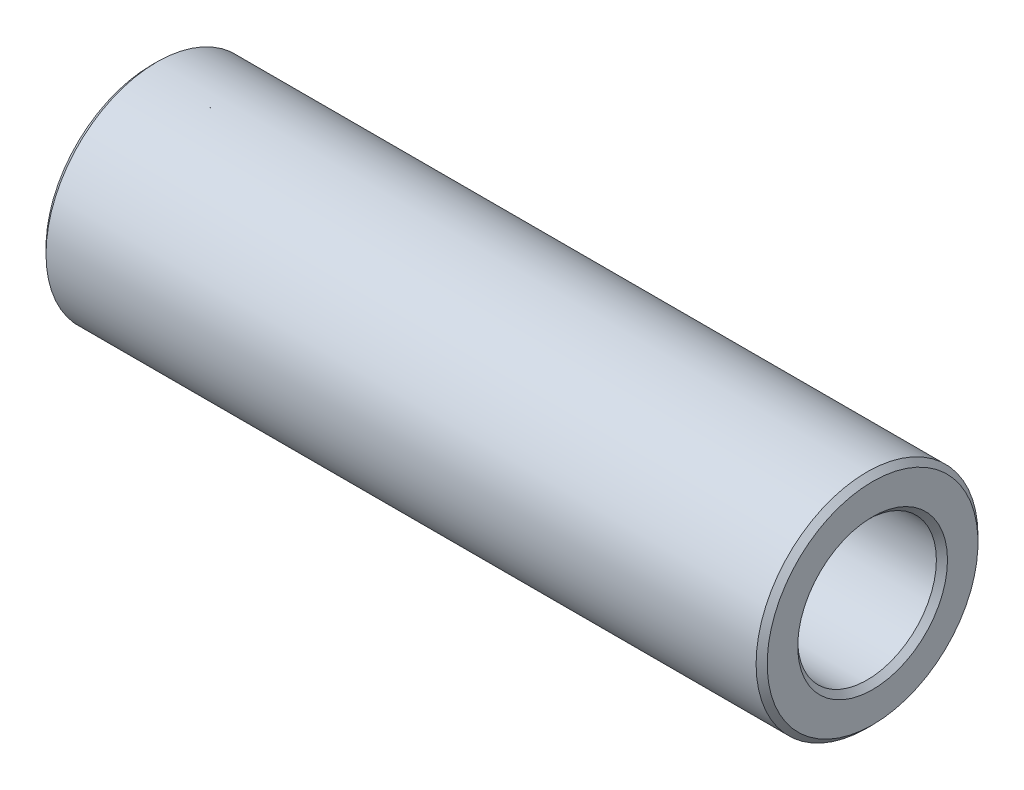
ISO-10303-21;
HEADER;
FILE_DESCRIPTION(('STEP AP214'),'2;1');
FILE_NAME('part.step','',(''),(''),'','','');
FILE_SCHEMA(('AUTOMOTIVE_DESIGN { 1 0 10303 214 1 1 1 1 }'));
ENDSEC;
DATA;
#1=APPLICATION_CONTEXT('core data for automotive mechanical design processes');
#2=APPLICATION_PROTOCOL_DEFINITION('international standard','automotive_design',2000,#1);
#3=PRODUCT_CONTEXT('',#1,'mechanical');
#4=PRODUCT('Part','Part','',(#3));
#5=PRODUCT_RELATED_PRODUCT_CATEGORY('part','',(#4));
#6=PRODUCT_DEFINITION_FORMATION('','',#4);
#7=PRODUCT_DEFINITION_CONTEXT('part definition',#1,'design');
#8=PRODUCT_DEFINITION('design','',#6,#7);
#9=PRODUCT_DEFINITION_SHAPE('','',#8);
#10=(LENGTH_UNIT() NAMED_UNIT(*) SI_UNIT(.MILLI.,.METRE.));
#11=(NAMED_UNIT(*) PLANE_ANGLE_UNIT() SI_UNIT($,.RADIAN.));
#12=(NAMED_UNIT(*) SI_UNIT($,.STERADIAN.) SOLID_ANGLE_UNIT());
#13=UNCERTAINTY_MEASURE_WITH_UNIT(LENGTH_MEASURE(1.E-05),#10,'distance_accuracy_value','');
#14=(GEOMETRIC_REPRESENTATION_CONTEXT(3) GLOBAL_UNCERTAINTY_ASSIGNED_CONTEXT((#13)) GLOBAL_UNIT_ASSIGNED_CONTEXT((#10,
#11,#12)) REPRESENTATION_CONTEXT('',''));
#15=CARTESIAN_POINT('',(0.,0.,0.));
#16=DIRECTION('',(0.,0.,1.));
#17=DIRECTION('',(1.,0.,0.));
#18=AXIS2_PLACEMENT_3D('',#15,#16,#17);
#19=CARTESIAN_POINT('',(-13.,0.,0.));
#20=DIRECTION('',(1.,0.,0.));
#21=DIRECTION('',(0.,0.,-1.));
#22=AXIS2_PLACEMENT_3D('',#19,#20,#21);
#23=CYLINDRICAL_SURFACE('',#22,2.5);
#24=CARTESIAN_POINT('',(-12.8000242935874,0.,0.));
#25=DIRECTION('',(-1.,0.,0.));
#26=DIRECTION('',(0.,0.,1.));
#27=AXIS2_PLACEMENT_3D('',#24,#25,#26);
#28=CIRCLE('',#27,2.5);
#29=CARTESIAN_POINT('',(-12.8000242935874,0.,2.5));
#30=VERTEX_POINT('',#29);
#31=EDGE_CURVE('E18',#30,#30,#28,.T.);
#32=ORIENTED_EDGE('',*,*,#31,.T.);
#33=EDGE_LOOP('',(#32));
#34=FACE_BOUND('',#33,.T.);
#35=CARTESIAN_POINT('',(12.8000242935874,0.,0.));
#36=DIRECTION('',(1.,0.,0.));
#37=DIRECTION('',(0.,0.,-1.));
#38=AXIS2_PLACEMENT_3D('',#35,#36,#37);
#39=CIRCLE('',#38,2.5);
#40=CARTESIAN_POINT('',(12.8000242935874,0.,-2.50000000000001));
#41=VERTEX_POINT('',#40);
#42=EDGE_CURVE('E40',#41,#41,#39,.T.);
#43=ORIENTED_EDGE('',*,*,#42,.T.);
#44=EDGE_LOOP('',(#43));
#45=FACE_BOUND('',#44,.T.);
#46=ADVANCED_FACE('F14',(#34,#45),#23,.F.);
#47=CARTESIAN_POINT('',(-13.0000113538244,0.,0.));
#48=DIRECTION('',(-1.,0.,0.));
#49=DIRECTION('',(0.,0.,1.));
#50=AXIS2_PLACEMENT_3D('',#47,#48,#49);
#51=CONICAL_SURFACE('',#50,2.69998511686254,0.785393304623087);
#52=ORIENTED_EDGE('',*,*,#31,.F.);
#53=EDGE_LOOP('',(#52));
#54=FACE_BOUND('',#53,.T.);
#55=CARTESIAN_POINT('',(-13.,0.,0.));
#56=DIRECTION('',(1.,0.,0.));
#57=DIRECTION('',(0.,0.,-1.));
#58=AXIS2_PLACEMENT_3D('',#55,#56,#57);
#59=CIRCLE('',#58,2.69997376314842);
#60=CARTESIAN_POINT('',(-13.,0.,-2.69997376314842));
#61=VERTEX_POINT('',#60);
#62=EDGE_CURVE('E38',#61,#61,#59,.F.);
#63=ORIENTED_EDGE('',*,*,#62,.T.);
#64=EDGE_LOOP('',(#63));
#65=FACE_BOUND('',#64,.T.);
#66=ADVANCED_FACE('F48',(#54,#65),#51,.F.);
#67=CARTESIAN_POINT('',(13.0000113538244,0.,0.));
#68=DIRECTION('',(1.,0.,0.));
#69=DIRECTION('',(0.,0.,-1.));
#70=AXIS2_PLACEMENT_3D('',#67,#68,#69);
#71=CONICAL_SURFACE('',#70,2.69998511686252,0.785393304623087);
#72=ORIENTED_EDGE('',*,*,#42,.F.);
#73=EDGE_LOOP('',(#72));
#74=FACE_BOUND('',#73,.T.);
#75=CARTESIAN_POINT('',(13.,0.,0.));
#76=DIRECTION('',(1.,0.,0.));
#77=DIRECTION('',(0.,0.,-1.));
#78=AXIS2_PLACEMENT_3D('',#75,#76,#77);
#79=CIRCLE('',#78,2.69997376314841);
#80=CARTESIAN_POINT('',(13.,0.,-2.69997376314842));
#81=VERTEX_POINT('',#80);
#82=EDGE_CURVE('E35',#81,#81,#79,.F.);
#83=ORIENTED_EDGE('',*,*,#82,.F.);
#84=EDGE_LOOP('',(#83));
#85=FACE_BOUND('',#84,.T.);
#86=ADVANCED_FACE('F51',(#74,#85),#71,.F.);
#87=CARTESIAN_POINT('',(-13.,0.,0.));
#88=DIRECTION('',(1.,0.,0.));
#89=DIRECTION('',(0.,0.,-1.));
#90=AXIS2_PLACEMENT_3D('',#87,#88,#89);
#91=PLANE('',#90);
#92=ORIENTED_EDGE('',*,*,#62,.F.);
#93=EDGE_LOOP('',(#92));
#94=FACE_BOUND('',#93,.T.);
#95=CARTESIAN_POINT('',(-12.9999997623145,0.,0.));
#96=DIRECTION('',(1.,0.,0.));
#97=DIRECTION('',(0.,1.,0.));
#98=AXIS2_PLACEMENT_3D('',#95,#96,#97);
#99=CIRCLE('',#98,3.79999808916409);
#100=CARTESIAN_POINT('',(-12.9999997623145,3.79999808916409,0.));
#101=VERTEX_POINT('',#100);
#102=EDGE_CURVE('E32',#101,#101,#99,.T.);
#103=ORIENTED_EDGE('',*,*,#102,.F.);
#104=EDGE_LOOP('',(#103));
#105=FACE_BOUND('',#104,.T.);
#106=ADVANCED_FACE('F55',(#94,#105),#91,.F.);
#107=CARTESIAN_POINT('',(13.,0.,0.));
#108=DIRECTION('',(1.,0.,0.));
#109=DIRECTION('',(0.,0.,-1.));
#110=AXIS2_PLACEMENT_3D('',#107,#108,#109);
#111=PLANE('',#110);
#112=ORIENTED_EDGE('',*,*,#82,.T.);
#113=EDGE_LOOP('',(#112));
#114=FACE_BOUND('',#113,.T.);
#115=CARTESIAN_POINT('',(12.9999997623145,0.,0.));
#116=DIRECTION('',(-1.,0.,0.));
#117=DIRECTION('',(0.,-1.,0.));
#118=AXIS2_PLACEMENT_3D('',#115,#116,#117);
#119=CIRCLE('',#118,3.79999808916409);
#120=CARTESIAN_POINT('',(12.9999997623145,-3.79999808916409,0.));
#121=VERTEX_POINT('',#120);
#122=EDGE_CURVE('E27',#121,#121,#119,.T.);
#123=ORIENTED_EDGE('',*,*,#122,.F.);
#124=EDGE_LOOP('',(#123));
#125=FACE_BOUND('',#124,.T.);
#126=ADVANCED_FACE('F58',(#114,#125),#111,.T.);
#127=CARTESIAN_POINT('',(-12.7999979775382,0.,0.));
#128=DIRECTION('',(1.,0.,0.));
#129=DIRECTION('',(0.,1.,0.));
#130=AXIS2_PLACEMENT_3D('',#127,#128,#129);
#131=CONICAL_SURFACE('',#130,3.99999976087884,0.78539788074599);
#132=CARTESIAN_POINT('',(-12.79999821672,0.,0.));
#133=DIRECTION('',(1.,0.,0.));
#134=DIRECTION('',(0.,0.,-1.));
#135=AXIS2_PLACEMENT_3D('',#132,#133,#134);
#136=CIRCLE('',#135,4.);
#137=CARTESIAN_POINT('',(-12.79999821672,0.,-4.));
#138=VERTEX_POINT('',#137);
#139=EDGE_CURVE('E22',#138,#138,#136,.T.);
#140=ORIENTED_EDGE('',*,*,#139,.F.);
#141=EDGE_LOOP('',(#140));
#142=FACE_BOUND('',#141,.T.);
#143=ORIENTED_EDGE('',*,*,#102,.T.);
#144=EDGE_LOOP('',(#143));
#145=FACE_BOUND('',#144,.T.);
#146=ADVANCED_FACE('F62',(#142,#145),#131,.T.);
#147=CARTESIAN_POINT('',(12.7999979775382,0.,0.));
#148=DIRECTION('',(-1.,0.,0.));
#149=DIRECTION('',(0.,-1.,0.));
#150=AXIS2_PLACEMENT_3D('',#147,#148,#149);
#151=CONICAL_SURFACE('',#150,3.99999976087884,0.78539788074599);
#152=CARTESIAN_POINT('',(12.79999821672,0.,0.));
#153=DIRECTION('',(1.,0.,0.));
#154=DIRECTION('',(0.,0.,-1.));
#155=AXIS2_PLACEMENT_3D('',#152,#153,#154);
#156=CIRCLE('',#155,4.);
#157=CARTESIAN_POINT('',(12.79999821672,0.,-4.));
#158=VERTEX_POINT('',#157);
#159=EDGE_CURVE('E10',#158,#158,#156,.F.);
#160=ORIENTED_EDGE('',*,*,#159,.F.);
#161=EDGE_LOOP('',(#160));
#162=FACE_BOUND('',#161,.T.);
#163=ORIENTED_EDGE('',*,*,#122,.T.);
#164=EDGE_LOOP('',(#163));
#165=FACE_BOUND('',#164,.T.);
#166=ADVANCED_FACE('F64',(#162,#165),#151,.T.);
#167=CARTESIAN_POINT('',(-13.,0.,0.));
#168=DIRECTION('',(1.,0.,0.));
#169=DIRECTION('',(0.,0.,-1.));
#170=AXIS2_PLACEMENT_3D('',#167,#168,#169);
#171=CYLINDRICAL_SURFACE('',#170,4.);
#172=ORIENTED_EDGE('',*,*,#139,.T.);
#173=EDGE_LOOP('',(#172));
#174=FACE_BOUND('',#173,.T.);
#175=ORIENTED_EDGE('',*,*,#159,.T.);
#176=EDGE_LOOP('',(#175));
#177=FACE_BOUND('',#176,.T.);
#178=ADVANCED_FACE('F16',(#174,#177),#171,.T.);
#179=CLOSED_SHELL('',(#46,#66,#86,#106,#126,#146,#166,#178));
#180=MANIFOLD_SOLID_BREP('B1',#179);
#181=ADVANCED_BREP_SHAPE_REPRESENTATION('',(#18,#180),#14);
#182=SHAPE_DEFINITION_REPRESENTATION(#9,#181);
ENDSEC;
END-ISO-10303-21;
